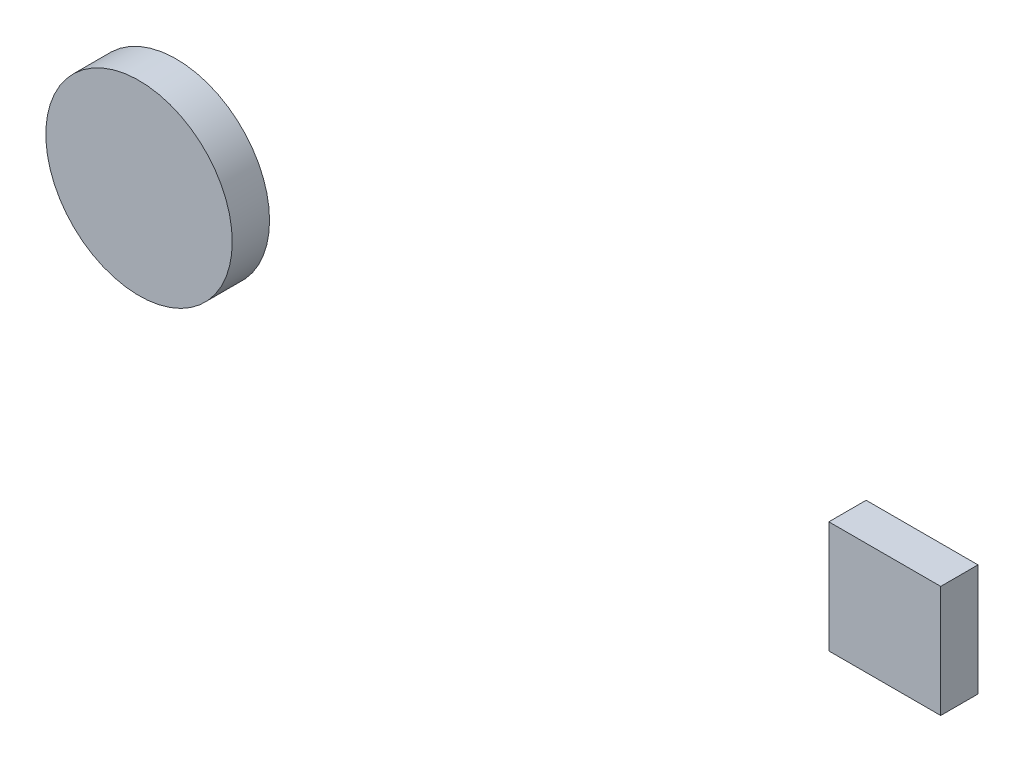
from build123d import *

# Parameters (mm, degrees)
SKETCH1_R           = 25
BOSS_EXTRUDE1_DEPTH = 10
SKETCH2_W           = 30
SKETCH2_H           = 30
BOSS_EXTRUDE2_DEPTH = 10


with BuildPart() as part:
    # Sketch1 → Boss-Extrude1 (new body)
    with BuildSketch(Plane.XY):
        Circle(SKETCH1_R)
    extrude(amount=BOSS_EXTRUDE1_DEPTH)


with BuildPart() as body_2:
    # Sketch2 → Boss-Extrude2 (new body)
    with BuildSketch(Plane.XY):
        with Locations((200, 0)):
            Rectangle(SKETCH2_W, SKETCH2_H)
    extrude(amount=BOSS_EXTRUDE2_DEPTH)


solid = Compound([part.part, body_2.part])
